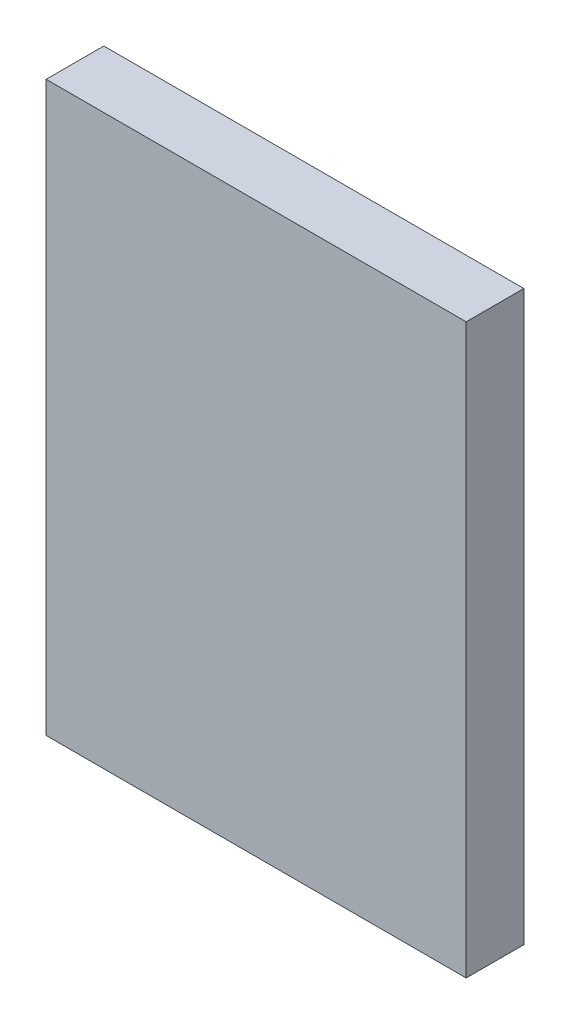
ISO-10303-21;
HEADER;
FILE_DESCRIPTION(('STEP AP214'),'2;1');
FILE_NAME('part.step','',(''),(''),'','','');
FILE_SCHEMA(('AUTOMOTIVE_DESIGN { 1 0 10303 214 1 1 1 1 }'));
ENDSEC;
DATA;
#1=APPLICATION_CONTEXT('core data for automotive mechanical design processes');
#2=APPLICATION_PROTOCOL_DEFINITION('international standard','automotive_design',2000,#1);
#3=PRODUCT_CONTEXT('',#1,'mechanical');
#4=PRODUCT('Part','Part','',(#3));
#5=PRODUCT_RELATED_PRODUCT_CATEGORY('part','',(#4));
#6=PRODUCT_DEFINITION_FORMATION('','',#4);
#7=PRODUCT_DEFINITION_CONTEXT('part definition',#1,'design');
#8=PRODUCT_DEFINITION('design','',#6,#7);
#9=PRODUCT_DEFINITION_SHAPE('','',#8);
#10=(LENGTH_UNIT() NAMED_UNIT(*) SI_UNIT(.MILLI.,.METRE.));
#11=(NAMED_UNIT(*) PLANE_ANGLE_UNIT() SI_UNIT($,.RADIAN.));
#12=(NAMED_UNIT(*) SI_UNIT($,.STERADIAN.) SOLID_ANGLE_UNIT());
#13=UNCERTAINTY_MEASURE_WITH_UNIT(LENGTH_MEASURE(1.E-05),#10,'distance_accuracy_value','');
#14=(GEOMETRIC_REPRESENTATION_CONTEXT(3) GLOBAL_UNCERTAINTY_ASSIGNED_CONTEXT((#13)) GLOBAL_UNIT_ASSIGNED_CONTEXT((#10,
#11,#12)) REPRESENTATION_CONTEXT('',''));
#15=CARTESIAN_POINT('',(0.,0.,0.));
#16=DIRECTION('',(0.,0.,1.));
#17=DIRECTION('',(1.,0.,0.));
#18=AXIS2_PLACEMENT_3D('',#15,#16,#17);
#19=CARTESIAN_POINT('',(-2.54949198,3.44949272,0.7));
#20=DIRECTION('',(0.,0.,-1.));
#21=DIRECTION('',(-1.,0.,0.));
#22=AXIS2_PLACEMENT_3D('',#19,#20,#21);
#23=PLANE('',#22);
#24=DIRECTION('',(1.,0.,0.));
#25=VECTOR('',#24,1.);
#26=CARTESIAN_POINT('',(-2.54949198,-3.44949018,0.7));
#27=LINE('',#26,#25);
#28=CARTESIAN_POINT('',(-2.54949198,-3.44949018,0.7));
#29=VERTEX_POINT('',#28);
#30=CARTESIAN_POINT('',(2.54949198,-3.44949018,0.7));
#31=VERTEX_POINT('',#30);
#32=EDGE_CURVE('E55',#29,#31,#27,.T.);
#33=ORIENTED_EDGE('',*,*,#32,.T.);
#34=DIRECTION('',(0.,1.,0.));
#35=VECTOR('',#34,1.);
#36=CARTESIAN_POINT('',(2.54949198,-3.44949018,0.7));
#37=LINE('',#36,#35);
#38=CARTESIAN_POINT('',(2.54949198,3.44949272,0.7));
#39=VERTEX_POINT('',#38);
#40=EDGE_CURVE('E57',#31,#39,#37,.T.);
#41=ORIENTED_EDGE('',*,*,#40,.T.);
#42=DIRECTION('',(1.,0.,0.));
#43=VECTOR('',#42,1.);
#44=CARTESIAN_POINT('',(2.54949198,3.44949272,0.7));
#45=LINE('',#44,#43);
#46=CARTESIAN_POINT('',(-2.54949198,3.44949272,0.7));
#47=VERTEX_POINT('',#46);
#48=EDGE_CURVE('E20',#39,#47,#45,.F.);
#49=ORIENTED_EDGE('',*,*,#48,.T.);
#50=DIRECTION('',(0.,1.,0.));
#51=VECTOR('',#50,1.);
#52=CARTESIAN_POINT('',(-2.54949198,3.44949272,0.7));
#53=LINE('',#52,#51);
#54=EDGE_CURVE('E80',#47,#29,#53,.F.);
#55=ORIENTED_EDGE('',*,*,#54,.T.);
#56=EDGE_LOOP('',(#33,#41,#49,#55));
#57=FACE_BOUND('',#56,.T.);
#58=ADVANCED_FACE('F17',(#57),#23,.F.);
#59=CARTESIAN_POINT('',(2.54949198,3.44949272,0.));
#60=DIRECTION('',(0.,-1.,0.));
#61=DIRECTION('',(0.,0.,-1.));
#62=AXIS2_PLACEMENT_3D('',#59,#60,#61);
#63=PLANE('',#62);
#64=DIRECTION('',(0.,0.,-1.));
#65=VECTOR('',#64,1.);
#66=CARTESIAN_POINT('',(-2.54949198,3.44949272,0.));
#67=LINE('',#66,#65);
#68=CARTESIAN_POINT('',(-2.54949198,3.44949272,0.));
#69=VERTEX_POINT('',#68);
#70=EDGE_CURVE('E68',#69,#47,#67,.F.);
#71=ORIENTED_EDGE('',*,*,#70,.T.);
#72=ORIENTED_EDGE('',*,*,#48,.F.);
#73=DIRECTION('',(0.,0.,1.));
#74=VECTOR('',#73,1.);
#75=CARTESIAN_POINT('',(2.54949198,3.44949272,0.));
#76=LINE('',#75,#74);
#77=CARTESIAN_POINT('',(2.54949198,3.44949272,0.));
#78=VERTEX_POINT('',#77);
#79=EDGE_CURVE('E63',#39,#78,#76,.F.);
#80=ORIENTED_EDGE('',*,*,#79,.T.);
#81=DIRECTION('',(-1.,0.,0.));
#82=VECTOR('',#81,1.);
#83=CARTESIAN_POINT('',(-2.54949198,3.44949272,0.));
#84=LINE('',#83,#82);
#85=EDGE_CURVE('E83',#69,#78,#84,.F.);
#86=ORIENTED_EDGE('',*,*,#85,.F.);
#87=EDGE_LOOP('',(#71,#72,#80,#86));
#88=FACE_BOUND('',#87,.T.);
#89=ADVANCED_FACE('F65',(#88),#63,.F.);
#90=CARTESIAN_POINT('',(2.54949198,-3.44949018,0.));
#91=DIRECTION('',(-1.,0.,0.));
#92=DIRECTION('',(0.,0.,1.));
#93=AXIS2_PLACEMENT_3D('',#90,#91,#92);
#94=PLANE('',#93);
#95=ORIENTED_EDGE('',*,*,#79,.F.);
#96=ORIENTED_EDGE('',*,*,#40,.F.);
#97=DIRECTION('',(0.,0.,1.));
#98=VECTOR('',#97,1.);
#99=CARTESIAN_POINT('',(2.54949198,-3.44949018,0.));
#100=LINE('',#99,#98);
#101=CARTESIAN_POINT('',(2.54949198,-3.44949018,0.));
#102=VERTEX_POINT('',#101);
#103=EDGE_CURVE('E75',#31,#102,#100,.F.);
#104=ORIENTED_EDGE('',*,*,#103,.T.);
#105=DIRECTION('',(0.,1.,0.));
#106=VECTOR('',#105,1.);
#107=CARTESIAN_POINT('',(2.54949198,3.44949272,0.));
#108=LINE('',#107,#106);
#109=EDGE_CURVE('E72',#78,#102,#108,.F.);
#110=ORIENTED_EDGE('',*,*,#109,.F.);
#111=EDGE_LOOP('',(#95,#96,#104,#110));
#112=FACE_BOUND('',#111,.T.);
#113=ADVANCED_FACE('F70',(#112),#94,.F.);
#114=CARTESIAN_POINT('',(-2.54949198,-3.44949018,0.));
#115=DIRECTION('',(0.,1.,0.));
#116=DIRECTION('',(0.,0.,1.));
#117=AXIS2_PLACEMENT_3D('',#114,#115,#116);
#118=PLANE('',#117);
#119=ORIENTED_EDGE('',*,*,#103,.F.);
#120=ORIENTED_EDGE('',*,*,#32,.F.);
#121=DIRECTION('',(0.,0.,-1.));
#122=VECTOR('',#121,1.);
#123=CARTESIAN_POINT('',(-2.54949198,-3.44949018,0.));
#124=LINE('',#123,#122);
#125=CARTESIAN_POINT('',(-2.54949198,-3.44949018,0.));
#126=VERTEX_POINT('',#125);
#127=EDGE_CURVE('E35',#29,#126,#124,.T.);
#128=ORIENTED_EDGE('',*,*,#127,.T.);
#129=DIRECTION('',(-1.,0.,0.));
#130=VECTOR('',#129,1.);
#131=CARTESIAN_POINT('',(-2.54949198,-3.44949018,0.));
#132=LINE('',#131,#130);
#133=EDGE_CURVE('E26',#102,#126,#132,.T.);
#134=ORIENTED_EDGE('',*,*,#133,.F.);
#135=EDGE_LOOP('',(#119,#120,#128,#134));
#136=FACE_BOUND('',#135,.T.);
#137=ADVANCED_FACE('F89',(#136),#118,.F.);
#138=CARTESIAN_POINT('',(-2.54949198,3.44949272,0.));
#139=DIRECTION('',(1.,0.,0.));
#140=DIRECTION('',(0.,0.,-1.));
#141=AXIS2_PLACEMENT_3D('',#138,#139,#140);
#142=PLANE('',#141);
#143=ORIENTED_EDGE('',*,*,#127,.F.);
#144=ORIENTED_EDGE('',*,*,#54,.F.);
#145=ORIENTED_EDGE('',*,*,#70,.F.);
#146=DIRECTION('',(0.,1.,0.));
#147=VECTOR('',#146,1.);
#148=CARTESIAN_POINT('',(-2.54949198,3.44949272,0.));
#149=LINE('',#148,#147);
#150=EDGE_CURVE('E11',#126,#69,#149,.T.);
#151=ORIENTED_EDGE('',*,*,#150,.F.);
#152=EDGE_LOOP('',(#143,#144,#145,#151));
#153=FACE_BOUND('',#152,.T.);
#154=ADVANCED_FACE('F91',(#153),#142,.F.);
#155=CARTESIAN_POINT('',(-2.54949198,3.44949272,0.));
#156=DIRECTION('',(0.,0.,-1.));
#157=DIRECTION('',(-1.,0.,0.));
#158=AXIS2_PLACEMENT_3D('',#155,#156,#157);
#159=PLANE('',#158);
#160=ORIENTED_EDGE('',*,*,#133,.T.);
#161=ORIENTED_EDGE('',*,*,#150,.T.);
#162=ORIENTED_EDGE('',*,*,#85,.T.);
#163=ORIENTED_EDGE('',*,*,#109,.T.);
#164=EDGE_LOOP('',(#160,#161,#162,#163));
#165=FACE_BOUND('',#164,.T.);
#166=ADVANCED_FACE('F88',(#165),#159,.T.);
#167=CLOSED_SHELL('',(#58,#89,#113,#137,#154,#166));
#168=MANIFOLD_SOLID_BREP('B1',#167);
#169=ADVANCED_BREP_SHAPE_REPRESENTATION('',(#18,#168),#14);
#170=SHAPE_DEFINITION_REPRESENTATION(#9,#169);
ENDSEC;
END-ISO-10303-21;
